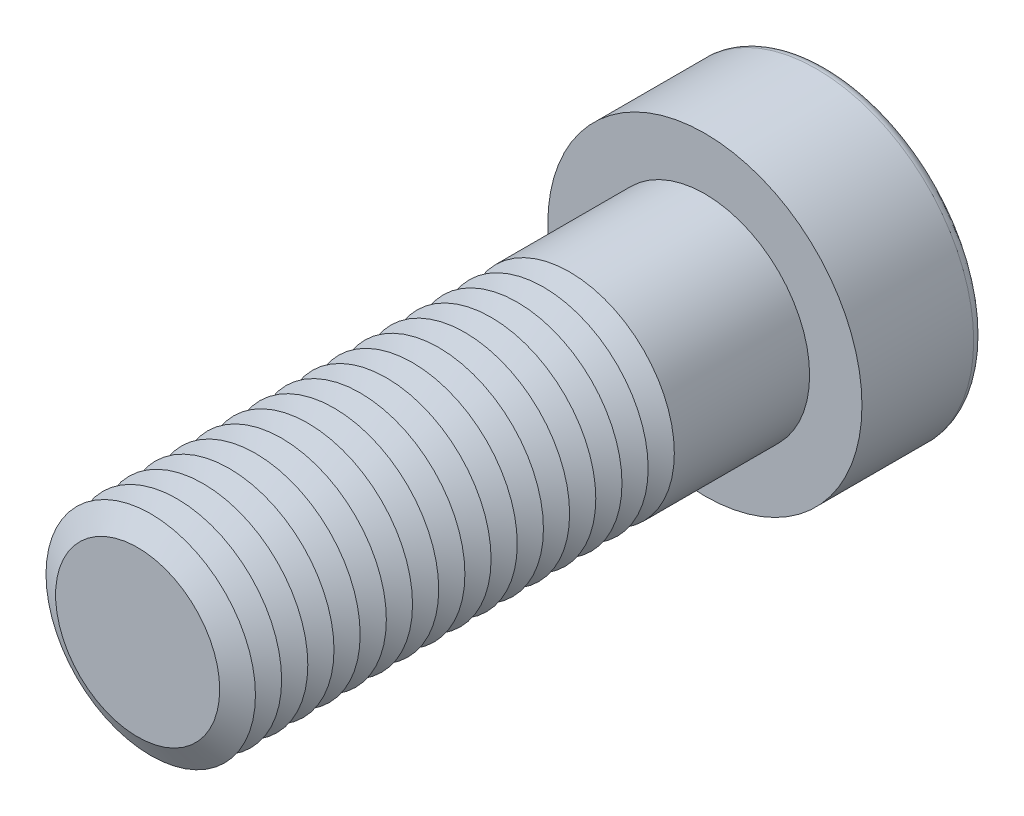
ISO-10303-21;
HEADER;
FILE_DESCRIPTION(('STEP AP214'),'2;1');
FILE_NAME('part.step','',(''),(''),'','','');
FILE_SCHEMA(('AUTOMOTIVE_DESIGN { 1 0 10303 214 1 1 1 1 }'));
ENDSEC;
DATA;
#1=APPLICATION_CONTEXT('core data for automotive mechanical design processes');
#2=APPLICATION_PROTOCOL_DEFINITION('international standard','automotive_design',2000,#1);
#3=PRODUCT_CONTEXT('',#1,'mechanical');
#4=PRODUCT('Part','Part','',(#3));
#5=PRODUCT_RELATED_PRODUCT_CATEGORY('part','',(#4));
#6=PRODUCT_DEFINITION_FORMATION('','',#4);
#7=PRODUCT_DEFINITION_CONTEXT('part definition',#1,'design');
#8=PRODUCT_DEFINITION('design','',#6,#7);
#9=PRODUCT_DEFINITION_SHAPE('','',#8);
#10=(LENGTH_UNIT() NAMED_UNIT(*) SI_UNIT(.MILLI.,.METRE.));
#11=(NAMED_UNIT(*) PLANE_ANGLE_UNIT() SI_UNIT($,.RADIAN.));
#12=(NAMED_UNIT(*) SI_UNIT($,.STERADIAN.) SOLID_ANGLE_UNIT());
#13=UNCERTAINTY_MEASURE_WITH_UNIT(LENGTH_MEASURE(1.E-05),#10,'distance_accuracy_value','');
#14=(GEOMETRIC_REPRESENTATION_CONTEXT(3) GLOBAL_UNCERTAINTY_ASSIGNED_CONTEXT((#13)) GLOBAL_UNIT_ASSIGNED_CONTEXT((#10,
#11,#12)) REPRESENTATION_CONTEXT('',''));
#15=CARTESIAN_POINT('',(0.,0.,0.));
#16=DIRECTION('',(0.,0.,1.));
#17=DIRECTION('',(1.,0.,0.));
#18=AXIS2_PLACEMENT_3D('',#15,#16,#17);
#19=CARTESIAN_POINT('',(0.,0.,54.5));
#20=DIRECTION('',(0.,0.,1.));
#21=DIRECTION('',(1.,0.,0.));
#22=AXIS2_PLACEMENT_3D('',#19,#20,#21);
#23=CONICAL_SURFACE('',#22,12.,1.0471975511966);
#24=CARTESIAN_POINT('',(0.,0.,53.));
#25=DIRECTION('',(0.,0.,1.));
#26=DIRECTION('',(1.,0.,0.));
#27=AXIS2_PLACEMENT_3D('',#24,#25,#26);
#28=CIRCLE('',#27,9.40192378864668);
#29=CARTESIAN_POINT('',(9.40192378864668,0.,53.));
#30=VERTEX_POINT('',#29);
#31=EDGE_CURVE('E313',#30,#30,#28,.T.);
#32=ORIENTED_EDGE('',*,*,#31,.T.);
#33=EDGE_LOOP('',(#32));
#34=FACE_BOUND('',#33,.T.);
#35=CARTESIAN_POINT('',(0.,0.,54.5));
#36=DIRECTION('',(0.,0.,1.));
#37=DIRECTION('',(1.,0.,0.));
#38=AXIS2_PLACEMENT_3D('',#35,#36,#37);
#39=CIRCLE('',#38,12.);
#40=CARTESIAN_POINT('',(12.,0.,54.5));
#41=VERTEX_POINT('',#40);
#42=EDGE_CURVE('E315',#41,#41,#39,.T.);
#43=ORIENTED_EDGE('',*,*,#42,.F.);
#44=EDGE_LOOP('',(#43));
#45=FACE_BOUND('',#44,.T.);
#46=ADVANCED_FACE('F39',(#34,#45),#23,.T.);
#47=CARTESIAN_POINT('',(0.,0.,53.));
#48=DIRECTION('',(0.,0.,-1.));
#49=DIRECTION('',(-1.,0.,0.));
#50=AXIS2_PLACEMENT_3D('',#47,#48,#49);
#51=CONICAL_SURFACE('',#50,9.40192378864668,1.0471975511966);
#52=CARTESIAN_POINT('',(0.,0.,51.5));
#53=DIRECTION('',(0.,0.,1.));
#54=DIRECTION('',(1.,0.,0.));
#55=AXIS2_PLACEMENT_3D('',#52,#53,#54);
#56=CIRCLE('',#55,12.);
#57=CARTESIAN_POINT('',(12.,0.,51.5));
#58=VERTEX_POINT('',#57);
#59=EDGE_CURVE('E323',#58,#58,#56,.T.);
#60=ORIENTED_EDGE('',*,*,#59,.T.);
#61=EDGE_LOOP('',(#60));
#62=FACE_BOUND('',#61,.T.);
#63=ORIENTED_EDGE('',*,*,#31,.F.);
#64=EDGE_LOOP('',(#63));
#65=FACE_BOUND('',#64,.T.);
#66=ADVANCED_FACE('F245',(#62,#65),#51,.T.);
#67=CARTESIAN_POINT('',(0.,0.,65.));
#68=DIRECTION('',(0.,0.,1.));
#69=DIRECTION('',(1.,0.,0.));
#70=AXIS2_PLACEMENT_3D('',#67,#68,#69);
#71=PLANE('',#70);
#72=CARTESIAN_POINT('',(0.,0.,65.));
#73=DIRECTION('',(0.,0.,1.));
#74=DIRECTION('',(1.,0.,0.));
#75=AXIS2_PLACEMENT_3D('',#72,#73,#74);
#76=CIRCLE('',#75,9.40192378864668);
#77=CARTESIAN_POINT('',(9.40192378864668,0.,65.));
#78=VERTEX_POINT('',#77);
#79=EDGE_CURVE('E174',#78,#78,#76,.T.);
#80=ORIENTED_EDGE('',*,*,#79,.T.);
#81=EDGE_LOOP('',(#80));
#82=FACE_BOUND('',#81,.T.);
#83=ADVANCED_FACE('F251',(#82),#71,.T.);
#84=CARTESIAN_POINT('',(0.,0.,65.));
#85=DIRECTION('',(0.,0.,-1.));
#86=DIRECTION('',(-1.,0.,0.));
#87=AXIS2_PLACEMENT_3D('',#84,#85,#86);
#88=CONICAL_SURFACE('',#87,9.40192378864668,1.0471975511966);
#89=CARTESIAN_POINT('',(0.,0.,63.5));
#90=DIRECTION('',(0.,0.,1.));
#91=DIRECTION('',(1.,0.,0.));
#92=AXIS2_PLACEMENT_3D('',#89,#90,#91);
#93=CIRCLE('',#92,12.);
#94=CARTESIAN_POINT('',(12.,0.,63.5));
#95=VERTEX_POINT('',#94);
#96=EDGE_CURVE('E291',#95,#95,#93,.T.);
#97=ORIENTED_EDGE('',*,*,#96,.T.);
#98=EDGE_LOOP('',(#97));
#99=FACE_BOUND('',#98,.T.);
#100=ORIENTED_EDGE('',*,*,#79,.F.);
#101=EDGE_LOOP('',(#100));
#102=FACE_BOUND('',#101,.T.);
#103=ADVANCED_FACE('F199',(#99,#102),#88,.T.);
#104=CARTESIAN_POINT('',(0.,0.,63.5));
#105=DIRECTION('',(0.,0.,1.));
#106=DIRECTION('',(1.,0.,0.));
#107=AXIS2_PLACEMENT_3D('',#104,#105,#106);
#108=CONICAL_SURFACE('',#107,12.,1.0471975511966);
#109=CARTESIAN_POINT('',(0.,0.,62.));
#110=DIRECTION('',(0.,0.,1.));
#111=DIRECTION('',(1.,0.,0.));
#112=AXIS2_PLACEMENT_3D('',#109,#110,#111);
#113=CIRCLE('',#112,9.40192378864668);
#114=CARTESIAN_POINT('',(9.40192378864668,0.,62.));
#115=VERTEX_POINT('',#114);
#116=EDGE_CURVE('E288',#115,#115,#113,.T.);
#117=ORIENTED_EDGE('',*,*,#116,.T.);
#118=EDGE_LOOP('',(#117));
#119=FACE_BOUND('',#118,.T.);
#120=ORIENTED_EDGE('',*,*,#96,.F.);
#121=EDGE_LOOP('',(#120));
#122=FACE_BOUND('',#121,.T.);
#123=ADVANCED_FACE('F277',(#119,#122),#108,.T.);
#124=CARTESIAN_POINT('',(0.,0.,62.));
#125=DIRECTION('',(0.,0.,-1.));
#126=DIRECTION('',(-1.,0.,0.));
#127=AXIS2_PLACEMENT_3D('',#124,#125,#126);
#128=CONICAL_SURFACE('',#127,9.40192378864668,1.0471975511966);
#129=CARTESIAN_POINT('',(0.,0.,60.5));
#130=DIRECTION('',(0.,0.,1.));
#131=DIRECTION('',(1.,0.,0.));
#132=AXIS2_PLACEMENT_3D('',#129,#130,#131);
#133=CIRCLE('',#132,12.);
#134=CARTESIAN_POINT('',(12.,0.,60.5));
#135=VERTEX_POINT('',#134);
#136=EDGE_CURVE('E299',#135,#135,#133,.T.);
#137=ORIENTED_EDGE('',*,*,#136,.T.);
#138=EDGE_LOOP('',(#137));
#139=FACE_BOUND('',#138,.T.);
#140=ORIENTED_EDGE('',*,*,#116,.F.);
#141=EDGE_LOOP('',(#140));
#142=FACE_BOUND('',#141,.T.);
#143=ADVANCED_FACE('F274',(#139,#142),#128,.T.);
#144=CARTESIAN_POINT('',(0.,0.,60.5));
#145=DIRECTION('',(0.,0.,1.));
#146=DIRECTION('',(1.,0.,0.));
#147=AXIS2_PLACEMENT_3D('',#144,#145,#146);
#148=CONICAL_SURFACE('',#147,12.,1.0471975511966);
#149=CARTESIAN_POINT('',(0.,0.,59.));
#150=DIRECTION('',(0.,0.,1.));
#151=DIRECTION('',(1.,0.,0.));
#152=AXIS2_PLACEMENT_3D('',#149,#150,#151);
#153=CIRCLE('',#152,9.40192378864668);
#154=CARTESIAN_POINT('',(9.40192378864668,0.,59.));
#155=VERTEX_POINT('',#154);
#156=EDGE_CURVE('E293',#155,#155,#153,.T.);
#157=ORIENTED_EDGE('',*,*,#156,.T.);
#158=EDGE_LOOP('',(#157));
#159=FACE_BOUND('',#158,.T.);
#160=ORIENTED_EDGE('',*,*,#136,.F.);
#161=EDGE_LOOP('',(#160));
#162=FACE_BOUND('',#161,.T.);
#163=ADVANCED_FACE('F270',(#159,#162),#148,.T.);
#164=CARTESIAN_POINT('',(0.,0.,59.));
#165=DIRECTION('',(0.,0.,-1.));
#166=DIRECTION('',(-1.,0.,0.));
#167=AXIS2_PLACEMENT_3D('',#164,#165,#166);
#168=CONICAL_SURFACE('',#167,9.40192378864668,1.0471975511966);
#169=CARTESIAN_POINT('',(0.,0.,57.5));
#170=DIRECTION('',(0.,0.,1.));
#171=DIRECTION('',(1.,0.,0.));
#172=AXIS2_PLACEMENT_3D('',#169,#170,#171);
#173=CIRCLE('',#172,12.);
#174=CARTESIAN_POINT('',(12.,0.,57.5));
#175=VERTEX_POINT('',#174);
#176=EDGE_CURVE('E309',#175,#175,#173,.T.);
#177=ORIENTED_EDGE('',*,*,#176,.T.);
#178=EDGE_LOOP('',(#177));
#179=FACE_BOUND('',#178,.T.);
#180=ORIENTED_EDGE('',*,*,#156,.F.);
#181=EDGE_LOOP('',(#180));
#182=FACE_BOUND('',#181,.T.);
#183=ADVANCED_FACE('F266',(#179,#182),#168,.T.);
#184=CARTESIAN_POINT('',(0.,0.,57.5));
#185=DIRECTION('',(0.,0.,1.));
#186=DIRECTION('',(1.,0.,0.));
#187=AXIS2_PLACEMENT_3D('',#184,#185,#186);
#188=CONICAL_SURFACE('',#187,12.,1.0471975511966);
#189=CARTESIAN_POINT('',(0.,0.,56.));
#190=DIRECTION('',(0.,0.,1.));
#191=DIRECTION('',(1.,0.,0.));
#192=AXIS2_PLACEMENT_3D('',#189,#190,#191);
#193=CIRCLE('',#192,9.40192378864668);
#194=CARTESIAN_POINT('',(9.40192378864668,0.,56.));
#195=VERTEX_POINT('',#194);
#196=EDGE_CURVE('E305',#195,#195,#193,.T.);
#197=ORIENTED_EDGE('',*,*,#196,.T.);
#198=EDGE_LOOP('',(#197));
#199=FACE_BOUND('',#198,.T.);
#200=ORIENTED_EDGE('',*,*,#176,.F.);
#201=EDGE_LOOP('',(#200));
#202=FACE_BOUND('',#201,.T.);
#203=ADVANCED_FACE('F262',(#199,#202),#188,.T.);
#204=CARTESIAN_POINT('',(0.,0.,56.));
#205=DIRECTION('',(0.,0.,-1.));
#206=DIRECTION('',(-1.,0.,0.));
#207=AXIS2_PLACEMENT_3D('',#204,#205,#206);
#208=CONICAL_SURFACE('',#207,9.40192378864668,1.0471975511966);
#209=ORIENTED_EDGE('',*,*,#42,.T.);
#210=EDGE_LOOP('',(#209));
#211=FACE_BOUND('',#210,.T.);
#212=ORIENTED_EDGE('',*,*,#196,.F.);
#213=EDGE_LOOP('',(#212));
#214=FACE_BOUND('',#213,.T.);
#215=ADVANCED_FACE('F258',(#211,#214),#208,.T.);
#216=CARTESIAN_POINT('',(0.,0.,51.5));
#217=DIRECTION('',(0.,0.,1.));
#218=DIRECTION('',(1.,0.,0.));
#219=AXIS2_PLACEMENT_3D('',#216,#217,#218);
#220=CONICAL_SURFACE('',#219,12.,1.0471975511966);
#221=CARTESIAN_POINT('',(0.,0.,50.));
#222=DIRECTION('',(0.,0.,1.));
#223=DIRECTION('',(1.,0.,0.));
#224=AXIS2_PLACEMENT_3D('',#221,#222,#223);
#225=CIRCLE('',#224,9.40192378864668);
#226=CARTESIAN_POINT('',(9.40192378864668,0.,50.));
#227=VERTEX_POINT('',#226);
#228=EDGE_CURVE('E319',#227,#227,#225,.T.);
#229=ORIENTED_EDGE('',*,*,#228,.T.);
#230=EDGE_LOOP('',(#229));
#231=FACE_BOUND('',#230,.T.);
#232=ORIENTED_EDGE('',*,*,#59,.F.);
#233=EDGE_LOOP('',(#232));
#234=FACE_BOUND('',#233,.T.);
#235=ADVANCED_FACE('F261',(#231,#234),#220,.T.);
#236=CARTESIAN_POINT('',(0.,0.,50.));
#237=DIRECTION('',(0.,0.,-1.));
#238=DIRECTION('',(-1.,0.,0.));
#239=AXIS2_PLACEMENT_3D('',#236,#237,#238);
#240=CONICAL_SURFACE('',#239,9.40192378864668,1.0471975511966);
#241=CARTESIAN_POINT('',(0.,0.,48.5));
#242=DIRECTION('',(0.,0.,1.));
#243=DIRECTION('',(1.,0.,0.));
#244=AXIS2_PLACEMENT_3D('',#241,#242,#243);
#245=CIRCLE('',#244,12.);
#246=CARTESIAN_POINT('',(12.,0.,48.5));
#247=VERTEX_POINT('',#246);
#248=EDGE_CURVE('E331',#247,#247,#245,.T.);
#249=ORIENTED_EDGE('',*,*,#248,.T.);
#250=EDGE_LOOP('',(#249));
#251=FACE_BOUND('',#250,.T.);
#252=ORIENTED_EDGE('',*,*,#228,.F.);
#253=EDGE_LOOP('',(#252));
#254=FACE_BOUND('',#253,.T.);
#255=ADVANCED_FACE('F512',(#251,#254),#240,.T.);
#256=CARTESIAN_POINT('',(0.,0.,48.5));
#257=DIRECTION('',(0.,0.,1.));
#258=DIRECTION('',(1.,0.,0.));
#259=AXIS2_PLACEMENT_3D('',#256,#257,#258);
#260=CONICAL_SURFACE('',#259,12.,1.0471975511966);
#261=CARTESIAN_POINT('',(0.,0.,47.));
#262=DIRECTION('',(0.,0.,1.));
#263=DIRECTION('',(1.,0.,0.));
#264=AXIS2_PLACEMENT_3D('',#261,#262,#263);
#265=CIRCLE('',#264,9.40192378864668);
#266=CARTESIAN_POINT('',(9.40192378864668,0.,47.));
#267=VERTEX_POINT('',#266);
#268=EDGE_CURVE('E327',#267,#267,#265,.T.);
#269=ORIENTED_EDGE('',*,*,#268,.T.);
#270=EDGE_LOOP('',(#269));
#271=FACE_BOUND('',#270,.T.);
#272=ORIENTED_EDGE('',*,*,#248,.F.);
#273=EDGE_LOOP('',(#272));
#274=FACE_BOUND('',#273,.T.);
#275=ADVANCED_FACE('F508',(#271,#274),#260,.T.);
#276=CARTESIAN_POINT('',(0.,0.,47.));
#277=DIRECTION('',(0.,0.,-1.));
#278=DIRECTION('',(-1.,0.,0.));
#279=AXIS2_PLACEMENT_3D('',#276,#277,#278);
#280=CONICAL_SURFACE('',#279,9.40192378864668,1.0471975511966);
#281=CARTESIAN_POINT('',(0.,0.,45.5));
#282=DIRECTION('',(0.,0.,1.));
#283=DIRECTION('',(1.,0.,0.));
#284=AXIS2_PLACEMENT_3D('',#281,#282,#283);
#285=CIRCLE('',#284,12.);
#286=CARTESIAN_POINT('',(12.,0.,45.5));
#287=VERTEX_POINT('',#286);
#288=EDGE_CURVE('E339',#287,#287,#285,.T.);
#289=ORIENTED_EDGE('',*,*,#288,.T.);
#290=EDGE_LOOP('',(#289));
#291=FACE_BOUND('',#290,.T.);
#292=ORIENTED_EDGE('',*,*,#268,.F.);
#293=EDGE_LOOP('',(#292));
#294=FACE_BOUND('',#293,.T.);
#295=ADVANCED_FACE('F504',(#291,#294),#280,.T.);
#296=CARTESIAN_POINT('',(0.,0.,45.5));
#297=DIRECTION('',(0.,0.,1.));
#298=DIRECTION('',(1.,0.,0.));
#299=AXIS2_PLACEMENT_3D('',#296,#297,#298);
#300=CONICAL_SURFACE('',#299,12.,1.0471975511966);
#301=CARTESIAN_POINT('',(0.,0.,44.));
#302=DIRECTION('',(0.,0.,1.));
#303=DIRECTION('',(1.,0.,0.));
#304=AXIS2_PLACEMENT_3D('',#301,#302,#303);
#305=CIRCLE('',#304,9.40192378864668);
#306=CARTESIAN_POINT('',(9.40192378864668,0.,44.));
#307=VERTEX_POINT('',#306);
#308=EDGE_CURVE('E335',#307,#307,#305,.T.);
#309=ORIENTED_EDGE('',*,*,#308,.T.);
#310=EDGE_LOOP('',(#309));
#311=FACE_BOUND('',#310,.T.);
#312=ORIENTED_EDGE('',*,*,#288,.F.);
#313=EDGE_LOOP('',(#312));
#314=FACE_BOUND('',#313,.T.);
#315=ADVANCED_FACE('F500',(#311,#314),#300,.T.);
#316=CARTESIAN_POINT('',(0.,0.,44.));
#317=DIRECTION('',(0.,0.,-1.));
#318=DIRECTION('',(-1.,0.,0.));
#319=AXIS2_PLACEMENT_3D('',#316,#317,#318);
#320=CONICAL_SURFACE('',#319,9.40192378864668,1.0471975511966);
#321=CARTESIAN_POINT('',(0.,0.,42.5));
#322=DIRECTION('',(0.,0.,1.));
#323=DIRECTION('',(1.,0.,0.));
#324=AXIS2_PLACEMENT_3D('',#321,#322,#323);
#325=CIRCLE('',#324,12.);
#326=CARTESIAN_POINT('',(12.,0.,42.5));
#327=VERTEX_POINT('',#326);
#328=EDGE_CURVE('E347',#327,#327,#325,.T.);
#329=ORIENTED_EDGE('',*,*,#328,.T.);
#330=EDGE_LOOP('',(#329));
#331=FACE_BOUND('',#330,.T.);
#332=ORIENTED_EDGE('',*,*,#308,.F.);
#333=EDGE_LOOP('',(#332));
#334=FACE_BOUND('',#333,.T.);
#335=ADVANCED_FACE('F496',(#331,#334),#320,.T.);
#336=CARTESIAN_POINT('',(0.,0.,42.5));
#337=DIRECTION('',(0.,0.,1.));
#338=DIRECTION('',(1.,0.,0.));
#339=AXIS2_PLACEMENT_3D('',#336,#337,#338);
#340=CONICAL_SURFACE('',#339,12.,1.0471975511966);
#341=CARTESIAN_POINT('',(0.,0.,41.));
#342=DIRECTION('',(0.,0.,1.));
#343=DIRECTION('',(1.,0.,0.));
#344=AXIS2_PLACEMENT_3D('',#341,#342,#343);
#345=CIRCLE('',#344,9.40192378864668);
#346=CARTESIAN_POINT('',(9.40192378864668,0.,41.));
#347=VERTEX_POINT('',#346);
#348=EDGE_CURVE('E343',#347,#347,#345,.T.);
#349=ORIENTED_EDGE('',*,*,#348,.T.);
#350=EDGE_LOOP('',(#349));
#351=FACE_BOUND('',#350,.T.);
#352=ORIENTED_EDGE('',*,*,#328,.F.);
#353=EDGE_LOOP('',(#352));
#354=FACE_BOUND('',#353,.T.);
#355=ADVANCED_FACE('F492',(#351,#354),#340,.T.);
#356=CARTESIAN_POINT('',(0.,0.,41.));
#357=DIRECTION('',(0.,0.,-1.));
#358=DIRECTION('',(-1.,0.,0.));
#359=AXIS2_PLACEMENT_3D('',#356,#357,#358);
#360=CONICAL_SURFACE('',#359,9.40192378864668,1.0471975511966);
#361=CARTESIAN_POINT('',(0.,0.,39.5));
#362=DIRECTION('',(0.,0.,1.));
#363=DIRECTION('',(1.,0.,0.));
#364=AXIS2_PLACEMENT_3D('',#361,#362,#363);
#365=CIRCLE('',#364,12.);
#366=CARTESIAN_POINT('',(12.,0.,39.5));
#367=VERTEX_POINT('',#366);
#368=EDGE_CURVE('E355',#367,#367,#365,.T.);
#369=ORIENTED_EDGE('',*,*,#368,.T.);
#370=EDGE_LOOP('',(#369));
#371=FACE_BOUND('',#370,.T.);
#372=ORIENTED_EDGE('',*,*,#348,.F.);
#373=EDGE_LOOP('',(#372));
#374=FACE_BOUND('',#373,.T.);
#375=ADVANCED_FACE('F488',(#371,#374),#360,.T.);
#376=CARTESIAN_POINT('',(0.,0.,39.5));
#377=DIRECTION('',(0.,0.,1.));
#378=DIRECTION('',(1.,0.,0.));
#379=AXIS2_PLACEMENT_3D('',#376,#377,#378);
#380=CONICAL_SURFACE('',#379,12.,1.0471975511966);
#381=CARTESIAN_POINT('',(0.,0.,38.));
#382=DIRECTION('',(0.,0.,1.));
#383=DIRECTION('',(1.,0.,0.));
#384=AXIS2_PLACEMENT_3D('',#381,#382,#383);
#385=CIRCLE('',#384,9.40192378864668);
#386=CARTESIAN_POINT('',(9.40192378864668,0.,38.));
#387=VERTEX_POINT('',#386);
#388=EDGE_CURVE('E351',#387,#387,#385,.T.);
#389=ORIENTED_EDGE('',*,*,#388,.T.);
#390=EDGE_LOOP('',(#389));
#391=FACE_BOUND('',#390,.T.);
#392=ORIENTED_EDGE('',*,*,#368,.F.);
#393=EDGE_LOOP('',(#392));
#394=FACE_BOUND('',#393,.T.);
#395=ADVANCED_FACE('F484',(#391,#394),#380,.T.);
#396=CARTESIAN_POINT('',(0.,0.,38.));
#397=DIRECTION('',(0.,0.,-1.));
#398=DIRECTION('',(-1.,0.,0.));
#399=AXIS2_PLACEMENT_3D('',#396,#397,#398);
#400=CONICAL_SURFACE('',#399,9.40192378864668,1.0471975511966);
#401=CARTESIAN_POINT('',(0.,0.,36.5));
#402=DIRECTION('',(0.,0.,1.));
#403=DIRECTION('',(1.,0.,0.));
#404=AXIS2_PLACEMENT_3D('',#401,#402,#403);
#405=CIRCLE('',#404,12.);
#406=CARTESIAN_POINT('',(12.,0.,36.5));
#407=VERTEX_POINT('',#406);
#408=EDGE_CURVE('E363',#407,#407,#405,.T.);
#409=ORIENTED_EDGE('',*,*,#408,.T.);
#410=EDGE_LOOP('',(#409));
#411=FACE_BOUND('',#410,.T.);
#412=ORIENTED_EDGE('',*,*,#388,.F.);
#413=EDGE_LOOP('',(#412));
#414=FACE_BOUND('',#413,.T.);
#415=ADVANCED_FACE('F480',(#411,#414),#400,.T.);
#416=CARTESIAN_POINT('',(0.,0.,36.5));
#417=DIRECTION('',(0.,0.,1.));
#418=DIRECTION('',(1.,0.,0.));
#419=AXIS2_PLACEMENT_3D('',#416,#417,#418);
#420=CONICAL_SURFACE('',#419,12.,1.0471975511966);
#421=CARTESIAN_POINT('',(0.,0.,35.));
#422=DIRECTION('',(0.,0.,1.));
#423=DIRECTION('',(1.,0.,0.));
#424=AXIS2_PLACEMENT_3D('',#421,#422,#423);
#425=CIRCLE('',#424,9.40192378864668);
#426=CARTESIAN_POINT('',(9.40192378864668,0.,35.));
#427=VERTEX_POINT('',#426);
#428=EDGE_CURVE('E359',#427,#427,#425,.T.);
#429=ORIENTED_EDGE('',*,*,#428,.T.);
#430=EDGE_LOOP('',(#429));
#431=FACE_BOUND('',#430,.T.);
#432=ORIENTED_EDGE('',*,*,#408,.F.);
#433=EDGE_LOOP('',(#432));
#434=FACE_BOUND('',#433,.T.);
#435=ADVANCED_FACE('F476',(#431,#434),#420,.T.);
#436=CARTESIAN_POINT('',(0.,0.,35.));
#437=DIRECTION('',(0.,0.,-1.));
#438=DIRECTION('',(-1.,0.,0.));
#439=AXIS2_PLACEMENT_3D('',#436,#437,#438);
#440=CONICAL_SURFACE('',#439,9.40192378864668,1.0471975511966);
#441=CARTESIAN_POINT('',(0.,0.,33.5));
#442=DIRECTION('',(0.,0.,1.));
#443=DIRECTION('',(1.,0.,0.));
#444=AXIS2_PLACEMENT_3D('',#441,#442,#443);
#445=CIRCLE('',#444,12.);
#446=CARTESIAN_POINT('',(12.,0.,33.5));
#447=VERTEX_POINT('',#446);
#448=EDGE_CURVE('E371',#447,#447,#445,.T.);
#449=ORIENTED_EDGE('',*,*,#448,.T.);
#450=EDGE_LOOP('',(#449));
#451=FACE_BOUND('',#450,.T.);
#452=ORIENTED_EDGE('',*,*,#428,.F.);
#453=EDGE_LOOP('',(#452));
#454=FACE_BOUND('',#453,.T.);
#455=ADVANCED_FACE('F472',(#451,#454),#440,.T.);
#456=CARTESIAN_POINT('',(0.,0.,33.5));
#457=DIRECTION('',(0.,0.,1.));
#458=DIRECTION('',(1.,0.,0.));
#459=AXIS2_PLACEMENT_3D('',#456,#457,#458);
#460=CONICAL_SURFACE('',#459,12.,1.0471975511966);
#461=CARTESIAN_POINT('',(0.,0.,32.));
#462=DIRECTION('',(0.,0.,1.));
#463=DIRECTION('',(1.,0.,0.));
#464=AXIS2_PLACEMENT_3D('',#461,#462,#463);
#465=CIRCLE('',#464,9.40192378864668);
#466=CARTESIAN_POINT('',(9.40192378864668,0.,32.));
#467=VERTEX_POINT('',#466);
#468=EDGE_CURVE('E367',#467,#467,#465,.T.);
#469=ORIENTED_EDGE('',*,*,#468,.T.);
#470=EDGE_LOOP('',(#469));
#471=FACE_BOUND('',#470,.T.);
#472=ORIENTED_EDGE('',*,*,#448,.F.);
#473=EDGE_LOOP('',(#472));
#474=FACE_BOUND('',#473,.T.);
#475=ADVANCED_FACE('F468',(#471,#474),#460,.T.);
#476=CARTESIAN_POINT('',(0.,0.,32.));
#477=DIRECTION('',(0.,0.,-1.));
#478=DIRECTION('',(-1.,0.,0.));
#479=AXIS2_PLACEMENT_3D('',#476,#477,#478);
#480=CONICAL_SURFACE('',#479,9.40192378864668,1.0471975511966);
#481=CARTESIAN_POINT('',(0.,0.,30.5));
#482=DIRECTION('',(0.,0.,1.));
#483=DIRECTION('',(1.,0.,0.));
#484=AXIS2_PLACEMENT_3D('',#481,#482,#483);
#485=CIRCLE('',#484,12.);
#486=CARTESIAN_POINT('',(12.,0.,30.5));
#487=VERTEX_POINT('',#486);
#488=EDGE_CURVE('E379',#487,#487,#485,.T.);
#489=ORIENTED_EDGE('',*,*,#488,.T.);
#490=EDGE_LOOP('',(#489));
#491=FACE_BOUND('',#490,.T.);
#492=ORIENTED_EDGE('',*,*,#468,.F.);
#493=EDGE_LOOP('',(#492));
#494=FACE_BOUND('',#493,.T.);
#495=ADVANCED_FACE('F464',(#491,#494),#480,.T.);
#496=CARTESIAN_POINT('',(0.,0.,30.5));
#497=DIRECTION('',(0.,0.,1.));
#498=DIRECTION('',(1.,0.,0.));
#499=AXIS2_PLACEMENT_3D('',#496,#497,#498);
#500=CONICAL_SURFACE('',#499,12.,1.0471975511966);
#501=CARTESIAN_POINT('',(0.,0.,29.));
#502=DIRECTION('',(0.,0.,1.));
#503=DIRECTION('',(1.,0.,0.));
#504=AXIS2_PLACEMENT_3D('',#501,#502,#503);
#505=CIRCLE('',#504,9.40192378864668);
#506=CARTESIAN_POINT('',(9.40192378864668,0.,29.));
#507=VERTEX_POINT('',#506);
#508=EDGE_CURVE('E375',#507,#507,#505,.T.);
#509=ORIENTED_EDGE('',*,*,#508,.T.);
#510=EDGE_LOOP('',(#509));
#511=FACE_BOUND('',#510,.T.);
#512=ORIENTED_EDGE('',*,*,#488,.F.);
#513=EDGE_LOOP('',(#512));
#514=FACE_BOUND('',#513,.T.);
#515=ADVANCED_FACE('F460',(#511,#514),#500,.T.);
#516=CARTESIAN_POINT('',(0.,0.,29.));
#517=DIRECTION('',(0.,0.,-1.));
#518=DIRECTION('',(-1.,0.,0.));
#519=AXIS2_PLACEMENT_3D('',#516,#517,#518);
#520=CONICAL_SURFACE('',#519,9.40192378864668,1.0471975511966);
#521=CARTESIAN_POINT('',(0.,0.,27.5));
#522=DIRECTION('',(0.,0.,1.));
#523=DIRECTION('',(1.,0.,0.));
#524=AXIS2_PLACEMENT_3D('',#521,#522,#523);
#525=CIRCLE('',#524,12.);
#526=CARTESIAN_POINT('',(12.,0.,27.5));
#527=VERTEX_POINT('',#526);
#528=EDGE_CURVE('E387',#527,#527,#525,.T.);
#529=ORIENTED_EDGE('',*,*,#528,.T.);
#530=EDGE_LOOP('',(#529));
#531=FACE_BOUND('',#530,.T.);
#532=ORIENTED_EDGE('',*,*,#508,.F.);
#533=EDGE_LOOP('',(#532));
#534=FACE_BOUND('',#533,.T.);
#535=ADVANCED_FACE('F456',(#531,#534),#520,.T.);
#536=CARTESIAN_POINT('',(0.,0.,27.5));
#537=DIRECTION('',(0.,0.,1.));
#538=DIRECTION('',(1.,0.,0.));
#539=AXIS2_PLACEMENT_3D('',#536,#537,#538);
#540=CONICAL_SURFACE('',#539,12.,1.0471975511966);
#541=CARTESIAN_POINT('',(0.,0.,26.));
#542=DIRECTION('',(0.,0.,1.));
#543=DIRECTION('',(1.,0.,0.));
#544=AXIS2_PLACEMENT_3D('',#541,#542,#543);
#545=CIRCLE('',#544,9.40192378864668);
#546=CARTESIAN_POINT('',(9.40192378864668,0.,26.));
#547=VERTEX_POINT('',#546);
#548=EDGE_CURVE('E383',#547,#547,#545,.T.);
#549=ORIENTED_EDGE('',*,*,#548,.T.);
#550=EDGE_LOOP('',(#549));
#551=FACE_BOUND('',#550,.T.);
#552=ORIENTED_EDGE('',*,*,#528,.F.);
#553=EDGE_LOOP('',(#552));
#554=FACE_BOUND('',#553,.T.);
#555=ADVANCED_FACE('F452',(#551,#554),#540,.T.);
#556=CARTESIAN_POINT('',(0.,0.,26.));
#557=DIRECTION('',(0.,0.,-1.));
#558=DIRECTION('',(-1.,0.,0.));
#559=AXIS2_PLACEMENT_3D('',#556,#557,#558);
#560=CONICAL_SURFACE('',#559,9.40192378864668,1.0471975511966);
#561=CARTESIAN_POINT('',(0.,0.,24.5));
#562=DIRECTION('',(0.,0.,1.));
#563=DIRECTION('',(1.,0.,0.));
#564=AXIS2_PLACEMENT_3D('',#561,#562,#563);
#565=CIRCLE('',#564,12.);
#566=CARTESIAN_POINT('',(12.,0.,24.5));
#567=VERTEX_POINT('',#566);
#568=EDGE_CURVE('E395',#567,#567,#565,.T.);
#569=ORIENTED_EDGE('',*,*,#568,.T.);
#570=EDGE_LOOP('',(#569));
#571=FACE_BOUND('',#570,.T.);
#572=ORIENTED_EDGE('',*,*,#548,.F.);
#573=EDGE_LOOP('',(#572));
#574=FACE_BOUND('',#573,.T.);
#575=ADVANCED_FACE('F448',(#571,#574),#560,.T.);
#576=CARTESIAN_POINT('',(0.,0.,24.5));
#577=DIRECTION('',(0.,0.,1.));
#578=DIRECTION('',(1.,0.,0.));
#579=AXIS2_PLACEMENT_3D('',#576,#577,#578);
#580=CONICAL_SURFACE('',#579,12.,1.0471975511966);
#581=CARTESIAN_POINT('',(0.,0.,23.));
#582=DIRECTION('',(0.,0.,1.));
#583=DIRECTION('',(1.,0.,0.));
#584=AXIS2_PLACEMENT_3D('',#581,#582,#583);
#585=CIRCLE('',#584,9.40192378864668);
#586=CARTESIAN_POINT('',(9.40192378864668,0.,23.));
#587=VERTEX_POINT('',#586);
#588=EDGE_CURVE('E391',#587,#587,#585,.T.);
#589=ORIENTED_EDGE('',*,*,#588,.T.);
#590=EDGE_LOOP('',(#589));
#591=FACE_BOUND('',#590,.T.);
#592=ORIENTED_EDGE('',*,*,#568,.F.);
#593=EDGE_LOOP('',(#592));
#594=FACE_BOUND('',#593,.T.);
#595=ADVANCED_FACE('F444',(#591,#594),#580,.T.);
#596=CARTESIAN_POINT('',(0.,0.,23.));
#597=DIRECTION('',(0.,0.,-1.));
#598=DIRECTION('',(-1.,0.,0.));
#599=AXIS2_PLACEMENT_3D('',#596,#597,#598);
#600=CONICAL_SURFACE('',#599,9.40192378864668,1.0471975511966);
#601=CARTESIAN_POINT('',(0.,0.,21.5));
#602=DIRECTION('',(0.,0.,1.));
#603=DIRECTION('',(1.,0.,0.));
#604=AXIS2_PLACEMENT_3D('',#601,#602,#603);
#605=CIRCLE('',#604,12.);
#606=CARTESIAN_POINT('',(12.,0.,21.5));
#607=VERTEX_POINT('',#606);
#608=EDGE_CURVE('E403',#607,#607,#605,.T.);
#609=ORIENTED_EDGE('',*,*,#608,.T.);
#610=EDGE_LOOP('',(#609));
#611=FACE_BOUND('',#610,.T.);
#612=ORIENTED_EDGE('',*,*,#588,.F.);
#613=EDGE_LOOP('',(#612));
#614=FACE_BOUND('',#613,.T.);
#615=ADVANCED_FACE('F440',(#611,#614),#600,.T.);
#616=CARTESIAN_POINT('',(0.,0.,21.5));
#617=DIRECTION('',(0.,0.,1.));
#618=DIRECTION('',(1.,0.,0.));
#619=AXIS2_PLACEMENT_3D('',#616,#617,#618);
#620=CONICAL_SURFACE('',#619,12.,1.0471975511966);
#621=CARTESIAN_POINT('',(0.,0.,20.));
#622=DIRECTION('',(0.,0.,1.));
#623=DIRECTION('',(1.,0.,0.));
#624=AXIS2_PLACEMENT_3D('',#621,#622,#623);
#625=CIRCLE('',#624,9.40192378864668);
#626=CARTESIAN_POINT('',(9.40192378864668,0.,20.));
#627=VERTEX_POINT('',#626);
#628=EDGE_CURVE('E399',#627,#627,#625,.T.);
#629=ORIENTED_EDGE('',*,*,#628,.T.);
#630=EDGE_LOOP('',(#629));
#631=FACE_BOUND('',#630,.T.);
#632=ORIENTED_EDGE('',*,*,#608,.F.);
#633=EDGE_LOOP('',(#632));
#634=FACE_BOUND('',#633,.T.);
#635=ADVANCED_FACE('F435',(#631,#634),#620,.T.);
#636=CARTESIAN_POINT('',(0.,0.,20.));
#637=DIRECTION('',(0.,0.,-1.));
#638=DIRECTION('',(-1.,0.,0.));
#639=AXIS2_PLACEMENT_3D('',#636,#637,#638);
#640=CONICAL_SURFACE('',#639,9.40192378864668,1.0471975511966);
#641=CARTESIAN_POINT('',(0.,0.,18.5));
#642=DIRECTION('',(0.,0.,1.));
#643=DIRECTION('',(1.,0.,0.));
#644=AXIS2_PLACEMENT_3D('',#641,#642,#643);
#645=CIRCLE('',#644,12.);
#646=CARTESIAN_POINT('',(12.,0.,18.5));
#647=VERTEX_POINT('',#646);
#648=EDGE_CURVE('E415',#647,#647,#645,.T.);
#649=ORIENTED_EDGE('',*,*,#648,.T.);
#650=EDGE_LOOP('',(#649));
#651=FACE_BOUND('',#650,.T.);
#652=ORIENTED_EDGE('',*,*,#628,.F.);
#653=EDGE_LOOP('',(#652));
#654=FACE_BOUND('',#653,.T.);
#655=ADVANCED_FACE('F421',(#651,#654),#640,.T.);
#656=CARTESIAN_POINT('',(0.,0.,18.5));
#657=DIRECTION('',(0.,0.,1.));
#658=DIRECTION('',(1.,0.,0.));
#659=AXIS2_PLACEMENT_3D('',#656,#657,#658);
#660=CONICAL_SURFACE('',#659,12.,1.0471975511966);
#661=CARTESIAN_POINT('',(0.,0.,17.));
#662=DIRECTION('',(0.,0.,1.));
#663=DIRECTION('',(1.,0.,0.));
#664=AXIS2_PLACEMENT_3D('',#661,#662,#663);
#665=CIRCLE('',#664,9.40192378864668);
#666=CARTESIAN_POINT('',(9.40192378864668,0.,17.));
#667=VERTEX_POINT('',#666);
#668=EDGE_CURVE('E407',#667,#667,#665,.T.);
#669=ORIENTED_EDGE('',*,*,#668,.T.);
#670=EDGE_LOOP('',(#669));
#671=FACE_BOUND('',#670,.T.);
#672=ORIENTED_EDGE('',*,*,#648,.F.);
#673=EDGE_LOOP('',(#672));
#674=FACE_BOUND('',#673,.T.);
#675=ADVANCED_FACE('F424',(#671,#674),#660,.T.);
#676=CARTESIAN_POINT('',(0.,0.,17.));
#677=DIRECTION('',(0.,0.,-1.));
#678=DIRECTION('',(-1.,0.,0.));
#679=AXIS2_PLACEMENT_3D('',#676,#677,#678);
#680=CONICAL_SURFACE('',#679,9.40192378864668,1.0471975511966);
#681=CARTESIAN_POINT('',(0.,0.,15.5));
#682=DIRECTION('',(0.,0.,1.));
#683=DIRECTION('',(1.,0.,0.));
#684=AXIS2_PLACEMENT_3D('',#681,#682,#683);
#685=CIRCLE('',#684,12.);
#686=CARTESIAN_POINT('',(12.,0.,15.5));
#687=VERTEX_POINT('',#686);
#688=EDGE_CURVE('E411',#687,#687,#685,.T.);
#689=ORIENTED_EDGE('',*,*,#688,.T.);
#690=EDGE_LOOP('',(#689));
#691=FACE_BOUND('',#690,.T.);
#692=ORIENTED_EDGE('',*,*,#668,.F.);
#693=EDGE_LOOP('',(#692));
#694=FACE_BOUND('',#693,.T.);
#695=ADVANCED_FACE('F426',(#691,#694),#680,.T.);
#696=CARTESIAN_POINT('',(0.,0.,0.25));
#697=DIRECTION('',(0.,0.,-1.));
#698=DIRECTION('',(-1.,0.,0.));
#699=AXIS2_PLACEMENT_3D('',#696,#697,#698);
#700=CONICAL_SURFACE('',#699,9.5,1.0471975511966);
#701=CARTESIAN_POINT('',(0.,0.,5.73482755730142));
#702=VERTEX_POINT('',#701);
#703=VERTEX_LOOP('',#702);
#704=FACE_BOUND('',#703,.T.);
#705=CARTESIAN_POINT('',(0.,0.,0.25));
#706=DIRECTION('',(0.,0.,-1.));
#707=DIRECTION('',(-1.,0.,0.));
#708=AXIS2_PLACEMENT_3D('',#705,#706,#707);
#709=CIRCLE('',#708,9.5);
#710=CARTESIAN_POINT('',(-8.22724133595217,4.75,0.25));
#711=VERTEX_POINT('',#710);
#712=CARTESIAN_POINT('',(0.,9.5,0.25));
#713=VERTEX_POINT('',#712);
#714=EDGE_CURVE('E149',#711,#713,#709,.T.);
#715=ORIENTED_EDGE('',*,*,#714,.T.);
#716=CARTESIAN_POINT('',(0.,0.,0.25));
#717=DIRECTION('',(0.,0.,-1.));
#718=DIRECTION('',(-1.,0.,0.));
#719=AXIS2_PLACEMENT_3D('',#716,#717,#718);
#720=CIRCLE('',#719,9.5);
#721=CARTESIAN_POINT('',(8.22724133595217,4.75,0.25));
#722=VERTEX_POINT('',#721);
#723=EDGE_CURVE('E54',#713,#722,#720,.T.);
#724=ORIENTED_EDGE('',*,*,#723,.T.);
#725=CARTESIAN_POINT('',(8.22724133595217,-4.75,0.25));
#726=VERTEX_POINT('',#725);
#727=EDGE_CURVE('E1027',#722,#726,#720,.T.);
#728=ORIENTED_EDGE('',*,*,#727,.T.);
#729=CARTESIAN_POINT('',(0.,-9.5,0.25));
#730=VERTEX_POINT('',#729);
#731=EDGE_CURVE('E1025',#726,#730,#720,.T.);
#732=ORIENTED_EDGE('',*,*,#731,.T.);
#733=CARTESIAN_POINT('',(-8.22724133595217,-4.75,0.25));
#734=VERTEX_POINT('',#733);
#735=EDGE_CURVE('E1019',#730,#734,#720,.T.);
#736=ORIENTED_EDGE('',*,*,#735,.T.);
#737=EDGE_CURVE('E1017',#734,#711,#720,.T.);
#738=ORIENTED_EDGE('',*,*,#737,.T.);
#739=EDGE_LOOP('',(#715,#724,#728,#732,#736,#738));
#740=FACE_BOUND('',#739,.T.);
#741=ADVANCED_FACE('F201',(#704,#740),#700,.F.);
#742=CARTESIAN_POINT('',(0.,0.,0.25));
#743=DIRECTION('',(0.,0.,-1.));
#744=DIRECTION('',(-1.,0.,0.));
#745=AXIS2_PLACEMENT_3D('',#742,#743,#744);
#746=PLANE('',#745);
#747=ORIENTED_EDGE('',*,*,#723,.F.);
#748=DIRECTION('',(1.,0.,0.));
#749=VECTOR('',#748,1.);
#750=CARTESIAN_POINT('',(-5.48482755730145,9.5,0.25));
#751=LINE('',#750,#749);
#752=CARTESIAN_POINT('',(5.48482755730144,9.5,0.25));
#753=VERTEX_POINT('',#752);
#754=EDGE_CURVE('E1068',#713,#753,#751,.T.);
#755=ORIENTED_EDGE('',*,*,#754,.T.);
#756=DIRECTION('',(0.5,-0.866025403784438,0.));
#757=VECTOR('',#756,1.);
#758=CARTESIAN_POINT('',(5.48482755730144,9.5,0.25));
#759=LINE('',#758,#757);
#760=EDGE_CURVE('E155',#753,#722,#759,.T.);
#761=ORIENTED_EDGE('',*,*,#760,.T.);
#762=EDGE_LOOP('',(#747,#755,#761));
#763=FACE_BOUND('',#762,.T.);
#764=ADVANCED_FACE('F607',(#763),#746,.T.);
#765=ORIENTED_EDGE('',*,*,#727,.F.);
#766=CARTESIAN_POINT('',(10.9696551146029,0.,0.25));
#767=VERTEX_POINT('',#766);
#768=EDGE_CURVE('E1067',#722,#767,#759,.T.);
#769=ORIENTED_EDGE('',*,*,#768,.T.);
#770=DIRECTION('',(-0.5,-0.866025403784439,0.));
#771=VECTOR('',#770,1.);
#772=CARTESIAN_POINT('',(10.9696551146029,0.,0.25));
#773=LINE('',#772,#771);
#774=EDGE_CURVE('E1040',#767,#726,#773,.T.);
#775=ORIENTED_EDGE('',*,*,#774,.T.);
#776=EDGE_LOOP('',(#765,#769,#775));
#777=FACE_BOUND('',#776,.T.);
#778=ADVANCED_FACE('F617',(#777),#746,.T.);
#779=ORIENTED_EDGE('',*,*,#731,.F.);
#780=CARTESIAN_POINT('',(5.48482755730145,-9.5,0.25));
#781=VERTEX_POINT('',#780);
#782=EDGE_CURVE('E1042',#726,#781,#773,.T.);
#783=ORIENTED_EDGE('',*,*,#782,.T.);
#784=DIRECTION('',(-1.,0.,0.));
#785=VECTOR('',#784,1.);
#786=CARTESIAN_POINT('',(5.48482755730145,-9.5,0.25));
#787=LINE('',#786,#785);
#788=EDGE_CURVE('E994',#781,#730,#787,.T.);
#789=ORIENTED_EDGE('',*,*,#788,.T.);
#790=EDGE_LOOP('',(#779,#783,#789));
#791=FACE_BOUND('',#790,.T.);
#792=ADVANCED_FACE('F627',(#791),#746,.T.);
#793=ORIENTED_EDGE('',*,*,#735,.F.);
#794=CARTESIAN_POINT('',(-5.48482755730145,-9.5,0.25));
#795=VERTEX_POINT('',#794);
#796=EDGE_CURVE('E1036',#730,#795,#787,.T.);
#797=ORIENTED_EDGE('',*,*,#796,.T.);
#798=DIRECTION('',(-0.5,0.866025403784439,0.));
#799=VECTOR('',#798,1.);
#800=CARTESIAN_POINT('',(-5.48482755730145,-9.5,0.25));
#801=LINE('',#800,#799);
#802=EDGE_CURVE('E1038',#795,#734,#801,.T.);
#803=ORIENTED_EDGE('',*,*,#802,.T.);
#804=EDGE_LOOP('',(#793,#797,#803));
#805=FACE_BOUND('',#804,.T.);
#806=ADVANCED_FACE('F635',(#805),#746,.T.);
#807=ORIENTED_EDGE('',*,*,#737,.F.);
#808=CARTESIAN_POINT('',(-10.9696551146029,0.,0.25));
#809=VERTEX_POINT('',#808);
#810=EDGE_CURVE('E1044',#734,#809,#801,.T.);
#811=ORIENTED_EDGE('',*,*,#810,.T.);
#812=DIRECTION('',(0.5,0.866025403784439,0.));
#813=VECTOR('',#812,1.);
#814=CARTESIAN_POINT('',(-10.9696551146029,0.,0.25));
#815=LINE('',#814,#813);
#816=EDGE_CURVE('E158',#809,#711,#815,.T.);
#817=ORIENTED_EDGE('',*,*,#816,.T.);
#818=EDGE_LOOP('',(#807,#811,#817));
#819=FACE_BOUND('',#818,.T.);
#820=ADVANCED_FACE('F231',(#819),#746,.T.);
#821=ORIENTED_EDGE('',*,*,#714,.F.);
#822=CARTESIAN_POINT('',(-5.48482755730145,9.5,0.25));
#823=VERTEX_POINT('',#822);
#824=EDGE_CURVE('E1052',#711,#823,#815,.T.);
#825=ORIENTED_EDGE('',*,*,#824,.T.);
#826=EDGE_CURVE('E1065',#823,#713,#751,.T.);
#827=ORIENTED_EDGE('',*,*,#826,.T.);
#828=EDGE_LOOP('',(#821,#825,#827));
#829=FACE_BOUND('',#828,.T.);
#830=ADVANCED_FACE('F619',(#829),#746,.T.);
#831=CARTESIAN_POINT('',(-5.48482755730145,9.5,0.25));
#832=DIRECTION('',(0.,1.,0.));
#833=DIRECTION('',(0.,0.,1.));
#834=AXIS2_PLACEMENT_3D('',#831,#832,#833);
#835=PLANE('',#834);
#836=DIRECTION('',(0.,0.,-1.));
#837=VECTOR('',#836,1.);
#838=CARTESIAN_POINT('',(-5.48482755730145,9.5,0.25));
#839=LINE('',#838,#837);
#840=CARTESIAN_POINT('',(-5.48482755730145,9.5,-14.));
#841=VERTEX_POINT('',#840);
#842=EDGE_CURVE('E147',#823,#841,#839,.T.);
#843=ORIENTED_EDGE('',*,*,#842,.T.);
#844=CARTESIAN_POINT('',(-14.3184360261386,9.5,-15.6649552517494));
#845=CARTESIAN_POINT('',(-13.8894653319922,9.5,-15.5692031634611));
#846=CARTESIAN_POINT('',(-13.460220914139,9.5,-15.4746548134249));
#847=CARTESIAN_POINT('',(-12.6010505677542,9.5,-15.2886152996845));
#848=CARTESIAN_POINT('',(-12.1711246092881,9.5,-15.1971242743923));
#849=CARTESIAN_POINT('',(-11.3100507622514,9.5,-15.0177651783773));
#850=CARTESIAN_POINT('',(-10.8789020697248,9.5,-14.9299009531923));
#851=CARTESIAN_POINT('',(-10.0156929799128,9.5,-14.7587741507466));
#852=CARTESIAN_POINT('',(-9.5836325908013,9.5,-14.67551153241));
#853=CARTESIAN_POINT('',(-8.72220045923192,9.5,-14.5153788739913));
#854=CARTESIAN_POINT('',(-8.29283790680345,9.5,-14.4384596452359));
#855=CARTESIAN_POINT('',(-7.43292010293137,9.5,-14.2915458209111));
#856=CARTESIAN_POINT('',(-7.0023648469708,9.5,-14.2215512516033));
#857=CARTESIAN_POINT('',(-6.14001360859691,9.5,-14.0901048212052));
#858=CARTESIAN_POINT('',(-5.70821784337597,9.5,-14.0286515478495));
#859=CARTESIAN_POINT('',(-4.84325961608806,9.5,-13.9161318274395));
#860=CARTESIAN_POINT('',(-4.41009715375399,9.5,-13.8650653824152));
#861=CARTESIAN_POINT('',(-3.53757113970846,9.5,-13.7748018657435));
#862=CARTESIAN_POINT('',(-3.09819281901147,9.5,-13.7357454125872));
#863=CARTESIAN_POINT('',(-2.2183738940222,9.5,-13.6722240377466));
#864=CARTESIAN_POINT('',(-1.77793331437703,9.5,-13.6477587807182));
#865=CARTESIAN_POINT('',(-0.896631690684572,9.5,-13.6148480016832));
#866=CARTESIAN_POINT('',(-0.455770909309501,9.5,-13.606395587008));
#867=CARTESIAN_POINT('',(0.425958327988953,9.5,-13.606024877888));
#868=CARTESIAN_POINT('',(0.866826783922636,9.5,-13.614106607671));
#869=CARTESIAN_POINT('',(1.74977048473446,9.5,-13.6463580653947));
#870=CARTESIAN_POINT('',(2.1918432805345,9.5,-13.6705935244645));
#871=CARTESIAN_POINT('',(3.07492453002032,9.5,-13.7337958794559));
#872=CARTESIAN_POINT('',(3.5159329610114,9.5,-13.7727630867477));
#873=CARTESIAN_POINT('',(4.39689734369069,9.5,-13.8635087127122));
#874=CARTESIAN_POINT('',(4.83685243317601,9.5,-13.9152953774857));
#875=CARTESIAN_POINT('',(5.71535222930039,9.5,-14.0295826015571));
#876=CARTESIAN_POINT('',(6.15389693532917,9.5,-14.0920831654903));
#877=CARTESIAN_POINT('',(7.04109045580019,9.5,-14.2276023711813));
#878=CARTESIAN_POINT('',(7.48970345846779,9.5,-14.3008534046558));
#879=CARTESIAN_POINT('',(8.38565999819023,9.5,-14.4547834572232));
#880=CARTESIAN_POINT('',(8.83300349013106,9.5,-14.5354627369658));
#881=CARTESIAN_POINT('',(9.72662836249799,9.5,-14.7027801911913));
#882=CARTESIAN_POINT('',(10.1729095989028,9.5,-14.7894191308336));
#883=CARTESIAN_POINT('',(11.0645098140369,9.5,-14.9674686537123));
#884=CARTESIAN_POINT('',(11.5098288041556,9.5,-15.0588791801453));
#885=CARTESIAN_POINT('',(12.3998049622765,9.5,-15.2455765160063));
#886=CARTESIAN_POINT('',(12.8444618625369,9.5,-15.3408645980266));
#887=CARTESIAN_POINT('',(13.7330947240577,9.5,-15.5345693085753));
#888=CARTESIAN_POINT('',(14.1770706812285,9.5,-15.6329859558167));
#889=CARTESIAN_POINT('',(15.5080689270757,9.5,-15.9320263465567));
#890=CARTESIAN_POINT('',(16.3942355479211,9.5,-16.1364562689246));
#891=CARTESIAN_POINT('',(18.1541693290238,9.5,-16.5497091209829));
#892=CARTESIAN_POINT('',(19.0279562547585,9.5,-16.7584484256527));
#893=CARTESIAN_POINT('',(20.7743818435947,9.5,-17.180754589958));
#894=CARTESIAN_POINT('',(21.647020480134,9.5,-17.3943215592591));
#895=CARTESIAN_POINT('',(23.3902098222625,9.5,-17.8246823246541));
#896=CARTESIAN_POINT('',(24.2607617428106,9.5,-18.0414712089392));
#897=CARTESIAN_POINT('',(25.5660757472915,9.5,-18.3686360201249));
#898=CARTESIAN_POINT('',(26.0010870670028,9.5,-18.4780192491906));
#899=CARTESIAN_POINT('',(26.8709622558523,9.5,-18.6973688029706));
#900=CARTESIAN_POINT('',(27.3058261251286,9.5,-18.8073351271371));
#901=CARTESIAN_POINT('',(27.7406260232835,9.5,-18.9175537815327));
#902=B_SPLINE_CURVE_WITH_KNOTS('',3,(#844,#845,#846,#847,#848,#849,#850,#851,#852,#853,#854,
#855,#856,#857,#858,#859,#860,#861,#862,#863,#864,#865,#866,#867,#868,#869,#870,#871,#872,#873,
#874,#875,#876,#877,#878,#879,#880,#881,#882,#883,#884,#885,#886,#887,#888,#889,#890,#891,#892,
#893,#894,#895,#896,#897,#898,#899,#900,#901),.UNSPECIFIED.,.F.,.F.,(4,2,2,2,2,2,2,2,2,2,2,2,2,
2,2,2,2,2,2,2,2,2,2,2,2,2,2,2,4),(0.,1.31858776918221,2.63723515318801,3.9572465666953,
5.27724619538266,6.5857950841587,7.89434893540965,9.20268616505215,10.5110236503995,
11.8341427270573,13.1572313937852,14.4797504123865,15.8022713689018,17.1302069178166,
18.4581705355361,19.7869905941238,21.1158112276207,22.4793957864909,23.8430282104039,
25.2068360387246,26.5706276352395,27.9348704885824,29.2991215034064,32.0273967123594,
34.7225025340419,37.4176696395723,40.1090806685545,41.4547385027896,42.8003950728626),.UNSPECIFIED.);
#903=CARTESIAN_POINT('',(5.48482755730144,9.50000000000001,-14.));
#904=VERTEX_POINT('',#903);
#905=EDGE_CURVE('E124',#841,#904,#902,.T.);
#906=ORIENTED_EDGE('',*,*,#905,.T.);
#907=DIRECTION('',(0.,0.,-1.));
#908=VECTOR('',#907,1.);
#909=CARTESIAN_POINT('',(5.48482755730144,9.5,0.25));
#910=LINE('',#909,#908);
#911=EDGE_CURVE('E143',#753,#904,#910,.T.);
#912=ORIENTED_EDGE('',*,*,#911,.F.);
#913=ORIENTED_EDGE('',*,*,#754,.F.);
#914=ORIENTED_EDGE('',*,*,#826,.F.);
#915=EDGE_LOOP('',(#843,#906,#912,#913,#914));
#916=FACE_BOUND('',#915,.T.);
#917=ADVANCED_FACE('F141',(#916),#835,.F.);
#918=CARTESIAN_POINT('',(5.48482755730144,9.5,0.25));
#919=DIRECTION('',(0.866025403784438,0.5,0.));
#920=DIRECTION('',(-0.5,0.866025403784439,0.));
#921=AXIS2_PLACEMENT_3D('',#918,#919,#920);
#922=PLANE('',#921);
#923=ORIENTED_EDGE('',*,*,#911,.T.);
#924=CARTESIAN_POINT('',(5.4847120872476,9.5002,-14.0000309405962));
#925=CARTESIAN_POINT('',(5.71249277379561,9.10567227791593,-13.9389722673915));
#926=CARTESIAN_POINT('',(5.9406864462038,8.71042924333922,-13.8835411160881));
#927=CARTESIAN_POINT('',(6.39787965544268,7.918547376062,-13.7861538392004));
#928=CARTESIAN_POINT('',(6.6268794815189,7.52190804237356,-13.7442031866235));
#929=CARTESIAN_POINT('',(7.08429660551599,6.72963834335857,-13.6762259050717));
#930=CARTESIAN_POINT('',(7.31271081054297,6.33401333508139,-13.6501182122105));
#931=CARTESIAN_POINT('',(7.76983049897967,5.54225880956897,-13.6151104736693));
#932=CARTESIAN_POINT('',(7.99853591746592,5.14612940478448,-13.6062070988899));
#933=CARTESIAN_POINT('',(8.45594675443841,4.35387059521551,-13.6062070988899));
#934=CARTESIAN_POINT('',(8.68465217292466,3.95774119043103,-13.6151104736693));
#935=CARTESIAN_POINT('',(9.14177186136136,3.16598666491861,-13.6501182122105));
#936=CARTESIAN_POINT('',(9.37018606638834,2.77036165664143,-13.6762259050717));
#937=CARTESIAN_POINT('',(9.82760319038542,1.97809195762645,-13.7442031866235));
#938=CARTESIAN_POINT('',(10.0566030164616,1.581452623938,-13.7861538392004));
#939=CARTESIAN_POINT('',(10.5137962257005,0.789570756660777,-13.8835411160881));
#940=CARTESIAN_POINT('',(10.7419898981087,0.394327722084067,-13.9389722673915));
#941=CARTESIAN_POINT('',(10.9697705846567,-0.000199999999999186,-14.0000309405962));
#942=B_SPLINE_CURVE_WITH_KNOTS('',3,(#924,#925,#926,#927,#928,#929,#930,#931,#932,#933,#934,
#935,#936,#937,#938,#939,#940,#941),.UNSPECIFIED.,.F.,.F.,(4,2,2,2,2,2,2,2,4),(0.,
1.37897722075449,2.75851359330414,4.13093041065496,5.50308163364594,6.87523285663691,
8.24764967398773,9.62718604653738,11.0061632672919),.UNSPECIFIED.);
#943=CARTESIAN_POINT('',(10.9696551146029,0.,-14.));
#944=VERTEX_POINT('',#943);
#945=EDGE_CURVE('E11',#904,#944,#942,.T.);
#946=ORIENTED_EDGE('',*,*,#945,.T.);
#947=DIRECTION('',(0.,0.,-1.));
#948=VECTOR('',#947,1.);
#949=CARTESIAN_POINT('',(10.9696551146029,0.,0.25));
#950=LINE('',#949,#948);
#951=EDGE_CURVE('E157',#767,#944,#950,.T.);
#952=ORIENTED_EDGE('',*,*,#951,.F.);
#953=ORIENTED_EDGE('',*,*,#768,.F.);
#954=ORIENTED_EDGE('',*,*,#760,.F.);
#955=EDGE_LOOP('',(#923,#946,#952,#953,#954));
#956=FACE_BOUND('',#955,.T.);
#957=ADVANCED_FACE('F152',(#956),#922,.F.);
#958=CARTESIAN_POINT('',(10.9696551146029,0.,0.25));
#959=DIRECTION('',(0.866025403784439,-0.5,0.));
#960=DIRECTION('',(0.5,0.866025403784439,0.));
#961=AXIS2_PLACEMENT_3D('',#958,#959,#960);
#962=PLANE('',#961);
#963=ORIENTED_EDGE('',*,*,#951,.T.);
#964=CARTESIAN_POINT('',(10.9697705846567,0.000200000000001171,-14.0000309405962));
#965=CARTESIAN_POINT('',(10.7419898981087,-0.394327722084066,-13.9389722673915));
#966=CARTESIAN_POINT('',(10.5137962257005,-0.789570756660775,-13.8835411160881));
#967=CARTESIAN_POINT('',(10.0566030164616,-1.581452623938,-13.7861538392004));
#968=CARTESIAN_POINT('',(9.82760319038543,-1.97809195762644,-13.7442031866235));
#969=CARTESIAN_POINT('',(9.37018606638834,-2.77036165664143,-13.6762259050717));
#970=CARTESIAN_POINT('',(9.14177186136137,-3.16598666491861,-13.6501182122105));
#971=CARTESIAN_POINT('',(8.68465217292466,-3.95774119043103,-13.6151104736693));
#972=CARTESIAN_POINT('',(8.45594675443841,-4.35387059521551,-13.6062070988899));
#973=CARTESIAN_POINT('',(7.99853591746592,-5.14612940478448,-13.6062070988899));
#974=CARTESIAN_POINT('',(7.76983049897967,-5.54225880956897,-13.6151104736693));
#975=CARTESIAN_POINT('',(7.31271081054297,-6.33401333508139,-13.6501182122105));
#976=CARTESIAN_POINT('',(7.08429660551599,-6.72963834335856,-13.6762259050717));
#977=CARTESIAN_POINT('',(6.62687948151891,-7.52190804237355,-13.7442031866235));
#978=CARTESIAN_POINT('',(6.39787965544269,-7.918547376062,-13.7861538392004));
#979=CARTESIAN_POINT('',(5.9406864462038,-8.71042924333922,-13.8835411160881));
#980=CARTESIAN_POINT('',(5.71249277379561,-9.10567227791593,-13.9389722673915));
#981=CARTESIAN_POINT('',(5.48471208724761,-9.5002,-14.0000309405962));
#982=B_SPLINE_CURVE_WITH_KNOTS('',3,(#964,#965,#966,#967,#968,#969,#970,#971,#972,#973,#974,
#975,#976,#977,#978,#979,#980,#981),.UNSPECIFIED.,.F.,.F.,(4,2,2,2,2,2,2,2,4),(0.,
1.37897722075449,2.75851359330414,4.13093041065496,5.50308163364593,6.87523285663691,
8.24764967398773,9.62718604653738,11.0061632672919),.UNSPECIFIED.);
#983=CARTESIAN_POINT('',(5.48482755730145,-9.5,-14.));
#984=VERTEX_POINT('',#983);
#985=EDGE_CURVE('E173',#944,#984,#982,.T.);
#986=ORIENTED_EDGE('',*,*,#985,.T.);
#987=DIRECTION('',(0.,0.,-1.));
#988=VECTOR('',#987,1.);
#989=CARTESIAN_POINT('',(5.48482755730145,-9.5,0.25));
#990=LINE('',#989,#988);
#991=EDGE_CURVE('E989',#781,#984,#990,.T.);
#992=ORIENTED_EDGE('',*,*,#991,.F.);
#993=ORIENTED_EDGE('',*,*,#782,.F.);
#994=ORIENTED_EDGE('',*,*,#774,.F.);
#995=EDGE_LOOP('',(#963,#986,#992,#993,#994));
#996=FACE_BOUND('',#995,.T.);
#997=ADVANCED_FACE('F191',(#996),#962,.F.);
#998=CARTESIAN_POINT('',(5.48482755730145,-9.5,0.25));
#999=DIRECTION('',(0.,-1.,0.));
#1000=DIRECTION('',(0.,0.,-1.));
#1001=AXIS2_PLACEMENT_3D('',#998,#999,#1000);
#1002=PLANE('',#1001);
#1003=ORIENTED_EDGE('',*,*,#991,.T.);
#1004=CARTESIAN_POINT('',(-14.3184360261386,-9.5,-15.6649552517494));
#1005=CARTESIAN_POINT('',(-13.8894653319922,-9.5,-15.5692031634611));
#1006=CARTESIAN_POINT('',(-13.460220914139,-9.5,-15.4746548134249));
#1007=CARTESIAN_POINT('',(-12.6010505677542,-9.5,-15.2886152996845));
#1008=CARTESIAN_POINT('',(-12.1711246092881,-9.5,-15.1971242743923));
#1009=CARTESIAN_POINT('',(-11.3100507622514,-9.5,-15.0177651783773));
#1010=CARTESIAN_POINT('',(-10.8789020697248,-9.5,-14.9299009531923));
#1011=CARTESIAN_POINT('',(-10.0156929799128,-9.5,-14.7587741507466));
#1012=CARTESIAN_POINT('',(-9.58363259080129,-9.5,-14.67551153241));
#1013=CARTESIAN_POINT('',(-8.72220045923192,-9.5,-14.5153788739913));
#1014=CARTESIAN_POINT('',(-8.29283790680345,-9.5,-14.4384596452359));
#1015=CARTESIAN_POINT('',(-7.43292010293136,-9.5,-14.2915458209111));
#1016=CARTESIAN_POINT('',(-7.00236484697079,-9.5,-14.2215512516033));
#1017=CARTESIAN_POINT('',(-6.1400136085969,-9.5,-14.0901048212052));
#1018=CARTESIAN_POINT('',(-5.70821784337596,-9.5,-14.0286515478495));
#1019=CARTESIAN_POINT('',(-4.84325961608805,-9.5,-13.9161318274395));
#1020=CARTESIAN_POINT('',(-4.41009715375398,-9.5,-13.8650653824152));
#1021=CARTESIAN_POINT('',(-3.53757113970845,-9.5,-13.7748018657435));
#1022=CARTESIAN_POINT('',(-3.09819281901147,-9.5,-13.7357454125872));
#1023=CARTESIAN_POINT('',(-2.2183738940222,-9.5,-13.6722240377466));
#1024=CARTESIAN_POINT('',(-1.77793331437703,-9.5,-13.6477587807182));
#1025=CARTESIAN_POINT('',(-0.896631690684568,-9.5,-13.6148480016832));
#1026=CARTESIAN_POINT('',(-0.455770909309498,-9.5,-13.606395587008));
#1027=CARTESIAN_POINT('',(0.425958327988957,-9.5,-13.606024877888));
#1028=CARTESIAN_POINT('',(0.866826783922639,-9.5,-13.614106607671));
#1029=CARTESIAN_POINT('',(1.74977048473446,-9.5,-13.6463580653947));
#1030=CARTESIAN_POINT('',(2.1918432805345,-9.5,-13.6705935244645));
#1031=CARTESIAN_POINT('',(3.07492453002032,-9.5,-13.7337958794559));
#1032=CARTESIAN_POINT('',(3.5159329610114,-9.5,-13.7727630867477));
#1033=CARTESIAN_POINT('',(4.39689734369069,-9.5,-13.8635087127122));
#1034=CARTESIAN_POINT('',(4.83685243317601,-9.5,-13.9152953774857));
#1035=CARTESIAN_POINT('',(5.71535222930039,-9.5,-14.0295826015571));
#1036=CARTESIAN_POINT('',(6.15389693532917,-9.5,-14.0920831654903));
#1037=CARTESIAN_POINT('',(7.04109045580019,-9.5,-14.2276023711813));
#1038=CARTESIAN_POINT('',(7.48970345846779,-9.5,-14.3008534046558));
#1039=CARTESIAN_POINT('',(8.38565999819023,-9.5,-14.4547834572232));
#1040=CARTESIAN_POINT('',(8.83300349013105,-9.5,-14.5354627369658));
#1041=CARTESIAN_POINT('',(9.72662836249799,-9.5,-14.7027801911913));
#1042=CARTESIAN_POINT('',(10.1729095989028,-9.5,-14.7894191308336));
#1043=CARTESIAN_POINT('',(11.0645098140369,-9.5,-14.9674686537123));
#1044=CARTESIAN_POINT('',(11.5098288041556,-9.5,-15.0588791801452));
#1045=CARTESIAN_POINT('',(12.3998049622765,-9.5,-15.2455765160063));
#1046=CARTESIAN_POINT('',(12.8444618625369,-9.5,-15.3408645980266));
#1047=CARTESIAN_POINT('',(13.7330947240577,-9.5,-15.5345693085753));
#1048=CARTESIAN_POINT('',(14.1770706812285,-9.5,-15.6329859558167));
#1049=CARTESIAN_POINT('',(15.5080689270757,-9.5,-15.9320263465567));
#1050=CARTESIAN_POINT('',(16.3942355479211,-9.5,-16.1364562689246));
#1051=CARTESIAN_POINT('',(18.1541693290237,-9.5,-16.5497091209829));
#1052=CARTESIAN_POINT('',(19.0279562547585,-9.5,-16.7584484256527));
#1053=CARTESIAN_POINT('',(20.7743818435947,-9.5,-17.180754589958));
#1054=CARTESIAN_POINT('',(21.647020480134,-9.5,-17.3943215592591));
#1055=CARTESIAN_POINT('',(23.3902098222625,-9.5,-17.8246823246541));
#1056=CARTESIAN_POINT('',(24.2607617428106,-9.5,-18.0414712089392));
#1057=CARTESIAN_POINT('',(25.5660757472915,-9.5,-18.3686360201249));
#1058=CARTESIAN_POINT('',(26.0010870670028,-9.5,-18.4780192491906));
#1059=CARTESIAN_POINT('',(26.8709622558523,-9.5,-18.6973688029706));
#1060=CARTESIAN_POINT('',(27.3058261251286,-9.5,-18.8073351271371));
#1061=CARTESIAN_POINT('',(27.7406260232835,-9.5,-18.9175537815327));
#1062=B_SPLINE_CURVE_WITH_KNOTS('',3,(#1004,#1005,#1006,#1007,#1008,#1009,#1010,#1011,#1012,
#1013,#1014,#1015,#1016,#1017,#1018,#1019,#1020,#1021,#1022,#1023,#1024,#1025,#1026,#1027,#1028,
#1029,#1030,#1031,#1032,#1033,#1034,#1035,#1036,#1037,#1038,#1039,#1040,#1041,#1042,#1043,#1044,
#1045,#1046,#1047,#1048,#1049,#1050,#1051,#1052,#1053,#1054,#1055,#1056,#1057,#1058,#1059,#1060,
#1061),.UNSPECIFIED.,.F.,.F.,(4,2,2,2,2,2,2,2,2,2,2,2,2,2,2,2,2,2,2,2,2,2,2,2,2,2,2,2,4),(0.,
1.3185877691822,2.63723515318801,3.9572465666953,5.27724619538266,6.5857950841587,
7.89434893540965,9.20268616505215,10.5110236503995,11.8341427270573,13.1572313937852,
14.4797504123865,15.8022713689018,17.1302069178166,18.4581705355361,19.7869905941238,
21.1158112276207,22.4793957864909,23.8430282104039,25.2068360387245,26.5706276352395,
27.9348704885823,29.2991215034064,32.0273967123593,34.7225025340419,37.4176696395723,
40.1090806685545,41.4547385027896,42.8003950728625),.UNSPECIFIED.);
#1063=CARTESIAN_POINT('',(-5.48482755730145,-9.5,-14.));
#1064=VERTEX_POINT('',#1063);
#1065=EDGE_CURVE('E184',#984,#1064,#1062,.F.);
#1066=ORIENTED_EDGE('',*,*,#1065,.T.);
#1067=DIRECTION('',(0.,0.,-1.));
#1068=VECTOR('',#1067,1.);
#1069=CARTESIAN_POINT('',(-5.48482755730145,-9.5,0.25));
#1070=LINE('',#1069,#1068);
#1071=EDGE_CURVE('E995',#795,#1064,#1070,.T.);
#1072=ORIENTED_EDGE('',*,*,#1071,.F.);
#1073=ORIENTED_EDGE('',*,*,#796,.F.);
#1074=ORIENTED_EDGE('',*,*,#788,.F.);
#1075=EDGE_LOOP('',(#1003,#1066,#1072,#1073,#1074));
#1076=FACE_BOUND('',#1075,.T.);
#1077=ADVANCED_FACE('F234',(#1076),#1002,.F.);
#1078=CARTESIAN_POINT('',(-5.48482755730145,-9.5,0.25));
#1079=DIRECTION('',(-0.866025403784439,-0.5,0.));
#1080=DIRECTION('',(0.5,-0.866025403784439,0.));
#1081=AXIS2_PLACEMENT_3D('',#1078,#1079,#1080);
#1082=PLANE('',#1081);
#1083=ORIENTED_EDGE('',*,*,#1071,.T.);
#1084=CARTESIAN_POINT('',(-5.48471208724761,-9.5002,-14.0000309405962));
#1085=CARTESIAN_POINT('',(-5.71249277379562,-9.10567227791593,-13.9389722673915));
#1086=CARTESIAN_POINT('',(-5.9406864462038,-8.71042924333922,-13.8835411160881));
#1087=CARTESIAN_POINT('',(-6.39787965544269,-7.918547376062,-13.7861538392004));
#1088=CARTESIAN_POINT('',(-6.62687948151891,-7.52190804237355,-13.7442031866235));
#1089=CARTESIAN_POINT('',(-7.084296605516,-6.72963834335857,-13.6762259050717));
#1090=CARTESIAN_POINT('',(-7.31271081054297,-6.33401333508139,-13.6501182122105));
#1091=CARTESIAN_POINT('',(-7.76983049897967,-5.54225880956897,-13.6151104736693));
#1092=CARTESIAN_POINT('',(-7.99853591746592,-5.14612940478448,-13.6062070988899));
#1093=CARTESIAN_POINT('',(-8.45594675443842,-4.35387059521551,-13.6062070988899));
#1094=CARTESIAN_POINT('',(-8.68465217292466,-3.95774119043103,-13.6151104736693));
#1095=CARTESIAN_POINT('',(-9.14177186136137,-3.16598666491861,-13.6501182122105));
#1096=CARTESIAN_POINT('',(-9.37018606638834,-2.77036165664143,-13.6762259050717));
#1097=CARTESIAN_POINT('',(-9.82760319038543,-1.97809195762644,-13.7442031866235));
#1098=CARTESIAN_POINT('',(-10.0566030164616,-1.581452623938,-13.7861538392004));
#1099=CARTESIAN_POINT('',(-10.5137962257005,-0.789570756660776,-13.8835411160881));
#1100=CARTESIAN_POINT('',(-10.7419898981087,-0.394327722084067,-13.9389722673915));
#1101=CARTESIAN_POINT('',(-10.9697705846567,0.0001999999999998,-14.0000309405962));
#1102=B_SPLINE_CURVE_WITH_KNOTS('',3,(#1084,#1085,#1086,#1087,#1088,#1089,#1090,#1091,#1092,
#1093,#1094,#1095,#1096,#1097,#1098,#1099,#1100,#1101),.UNSPECIFIED.,.F.,.F.,(4,2,2,2,2,2,2,2,
4),(0.,1.37897722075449,2.75851359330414,4.13093041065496,5.50308163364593,6.87523285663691,
8.24764967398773,9.62718604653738,11.0061632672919),.UNSPECIFIED.);
#1103=CARTESIAN_POINT('',(-10.9696551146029,0.,-14.));
#1104=VERTEX_POINT('',#1103);
#1105=EDGE_CURVE('E208',#1064,#1104,#1102,.T.);
#1106=ORIENTED_EDGE('',*,*,#1105,.T.);
#1107=DIRECTION('',(0.,0.,-1.));
#1108=VECTOR('',#1107,1.);
#1109=CARTESIAN_POINT('',(-10.9696551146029,0.,0.25));
#1110=LINE('',#1109,#1108);
#1111=EDGE_CURVE('E997',#809,#1104,#1110,.T.);
#1112=ORIENTED_EDGE('',*,*,#1111,.F.);
#1113=ORIENTED_EDGE('',*,*,#810,.F.);
#1114=ORIENTED_EDGE('',*,*,#802,.F.);
#1115=EDGE_LOOP('',(#1083,#1106,#1112,#1113,#1114));
#1116=FACE_BOUND('',#1115,.T.);
#1117=ADVANCED_FACE('F229',(#1116),#1082,.F.);
#1118=CARTESIAN_POINT('',(-10.9696551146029,0.,0.25));
#1119=DIRECTION('',(-0.866025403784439,0.5,0.));
#1120=DIRECTION('',(-0.5,-0.866025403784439,0.));
#1121=AXIS2_PLACEMENT_3D('',#1118,#1119,#1120);
#1122=PLANE('',#1121);
#1123=ORIENTED_EDGE('',*,*,#1111,.T.);
#1124=CARTESIAN_POINT('',(-10.9697705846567,-0.000199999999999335,-14.0000309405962));
#1125=CARTESIAN_POINT('',(-10.7419898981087,0.394327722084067,-13.9389722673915));
#1126=CARTESIAN_POINT('',(-10.5137962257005,0.789570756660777,-13.8835411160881));
#1127=CARTESIAN_POINT('',(-10.0566030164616,1.581452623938,-13.7861538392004));
#1128=CARTESIAN_POINT('',(-9.82760319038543,1.97809195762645,-13.7442031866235));
#1129=CARTESIAN_POINT('',(-9.37018606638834,2.77036165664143,-13.6762259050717));
#1130=CARTESIAN_POINT('',(-9.14177186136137,3.16598666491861,-13.6501182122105));
#1131=CARTESIAN_POINT('',(-8.68465217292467,3.95774119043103,-13.6151104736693));
#1132=CARTESIAN_POINT('',(-8.45594675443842,4.35387059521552,-13.6062070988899));
#1133=CARTESIAN_POINT('',(-7.99853591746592,5.14612940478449,-13.6062070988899));
#1134=CARTESIAN_POINT('',(-7.76983049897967,5.54225880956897,-13.6151104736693));
#1135=CARTESIAN_POINT('',(-7.31271081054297,6.33401333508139,-13.6501182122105));
#1136=CARTESIAN_POINT('',(-7.084296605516,6.72963834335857,-13.6762259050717));
#1137=CARTESIAN_POINT('',(-6.62687948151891,7.52190804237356,-13.7442031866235));
#1138=CARTESIAN_POINT('',(-6.3978796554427,7.918547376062,-13.7861538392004));
#1139=CARTESIAN_POINT('',(-5.94068644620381,8.71042924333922,-13.8835411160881));
#1140=CARTESIAN_POINT('',(-5.71249277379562,9.10567227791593,-13.9389722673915));
#1141=CARTESIAN_POINT('',(-5.48471208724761,9.5002,-14.0000309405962));
#1142=B_SPLINE_CURVE_WITH_KNOTS('',3,(#1124,#1125,#1126,#1127,#1128,#1129,#1130,#1131,#1132,
#1133,#1134,#1135,#1136,#1137,#1138,#1139,#1140,#1141),.UNSPECIFIED.,.F.,.F.,(4,2,2,2,2,2,2,2,
4),(0.,1.37897722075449,2.75851359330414,4.13093041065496,5.50308163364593,6.87523285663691,
8.24764967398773,9.62718604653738,11.0061632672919),.UNSPECIFIED.);
#1143=EDGE_CURVE('E150',#1104,#841,#1142,.T.);
#1144=ORIENTED_EDGE('',*,*,#1143,.T.);
#1145=ORIENTED_EDGE('',*,*,#842,.F.);
#1146=ORIENTED_EDGE('',*,*,#824,.F.);
#1147=ORIENTED_EDGE('',*,*,#816,.F.);
#1148=EDGE_LOOP('',(#1123,#1144,#1145,#1146,#1147));
#1149=FACE_BOUND('',#1148,.T.);
#1150=ADVANCED_FACE('F197',(#1149),#1122,.F.);
#1151=CARTESIAN_POINT('',(0.,0.,-14.));
#1152=DIRECTION('',(0.,0.,-1.));
#1153=DIRECTION('',(-1.,0.,0.));
#1154=AXIS2_PLACEMENT_3D('',#1151,#1152,#1153);
#1155=CONICAL_SURFACE('',#1154,10.9696551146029,1.30899693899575);
#1156=CARTESIAN_POINT('',(0.,0.,-14.));
#1157=DIRECTION('',(0.,0.,-1.));
#1158=DIRECTION('',(-1.,0.,0.));
#1159=AXIS2_PLACEMENT_3D('',#1156,#1157,#1158);
#1160=CIRCLE('',#1159,10.9696551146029);
#1161=EDGE_CURVE('E120',#841,#904,#1160,.T.);
#1162=ORIENTED_EDGE('',*,*,#1161,.T.);
#1163=ORIENTED_EDGE('',*,*,#905,.F.);
#1164=EDGE_LOOP('',(#1162,#1163));
#1165=FACE_BOUND('',#1164,.T.);
#1166=ADVANCED_FACE('F122',(#1165),#1155,.F.);
#1167=EDGE_CURVE('E129',#904,#944,#1160,.T.);
#1168=ORIENTED_EDGE('',*,*,#1167,.T.);
#1169=ORIENTED_EDGE('',*,*,#945,.F.);
#1170=EDGE_LOOP('',(#1168,#1169));
#1171=FACE_BOUND('',#1170,.T.);
#1172=ADVANCED_FACE('F133',(#1171),#1155,.F.);
#1173=EDGE_CURVE('E164',#944,#984,#1160,.T.);
#1174=ORIENTED_EDGE('',*,*,#1173,.T.);
#1175=ORIENTED_EDGE('',*,*,#985,.F.);
#1176=EDGE_LOOP('',(#1174,#1175));
#1177=FACE_BOUND('',#1176,.T.);
#1178=ADVANCED_FACE('F700',(#1177),#1155,.F.);
#1179=EDGE_CURVE('E169',#984,#1064,#1160,.T.);
#1180=ORIENTED_EDGE('',*,*,#1179,.T.);
#1181=ORIENTED_EDGE('',*,*,#1065,.F.);
#1182=EDGE_LOOP('',(#1180,#1181));
#1183=FACE_BOUND('',#1182,.T.);
#1184=ADVANCED_FACE('F707',(#1183),#1155,.F.);
#1185=EDGE_CURVE('E67',#1064,#1104,#1160,.T.);
#1186=ORIENTED_EDGE('',*,*,#1185,.T.);
#1187=ORIENTED_EDGE('',*,*,#1105,.F.);
#1188=EDGE_LOOP('',(#1186,#1187));
#1189=FACE_BOUND('',#1188,.T.);
#1190=ADVANCED_FACE('F715',(#1189),#1155,.F.);
#1191=EDGE_CURVE('E60',#1104,#841,#1160,.T.);
#1192=ORIENTED_EDGE('',*,*,#1191,.T.);
#1193=ORIENTED_EDGE('',*,*,#1143,.F.);
#1194=EDGE_LOOP('',(#1192,#1193));
#1195=FACE_BOUND('',#1194,.T.);
#1196=ADVANCED_FACE('F198',(#1195),#1155,.F.);
#1197=CARTESIAN_POINT('',(0.,0.,-14.));
#1198=DIRECTION('',(0.,0.,-1.));
#1199=DIRECTION('',(-1.,0.,0.));
#1200=AXIS2_PLACEMENT_3D('',#1197,#1198,#1199);
#1201=PLANE('',#1200);
#1202=ORIENTED_EDGE('',*,*,#1191,.F.);
#1203=ORIENTED_EDGE('',*,*,#1185,.F.);
#1204=ORIENTED_EDGE('',*,*,#1179,.F.);
#1205=ORIENTED_EDGE('',*,*,#1173,.F.);
#1206=ORIENTED_EDGE('',*,*,#1167,.F.);
#1207=ORIENTED_EDGE('',*,*,#1161,.F.);
#1208=EDGE_LOOP('',(#1202,#1203,#1204,#1205,#1206,#1207));
#1209=FACE_BOUND('',#1208,.T.);
#1210=CARTESIAN_POINT('',(0.,0.,-14.));
#1211=DIRECTION('',(0.,0.,-1.));
#1212=DIRECTION('',(-1.,0.,0.));
#1213=AXIS2_PLACEMENT_3D('',#1210,#1211,#1212);
#1214=CIRCLE('',#1213,16.8);
#1215=CARTESIAN_POINT('',(-16.8,0.,-14.));
#1216=VERTEX_POINT('',#1215);
#1217=EDGE_CURVE('E1010',#1216,#1216,#1214,.T.);
#1218=ORIENTED_EDGE('',*,*,#1217,.T.);
#1219=EDGE_LOOP('',(#1218));
#1220=FACE_BOUND('',#1219,.T.);
#1221=ADVANCED_FACE('F161',(#1209,#1220),#1201,.T.);
#1222=CARTESIAN_POINT('',(0.,0.,-12.8));
#1223=DIRECTION('',(0.,0.,-1.));
#1224=DIRECTION('',(-1.,0.,0.));
#1225=AXIS2_PLACEMENT_3D('',#1222,#1223,#1224);
#1226=TOROIDAL_SURFACE('',#1225,16.8,1.2);
#1227=CARTESIAN_POINT('',(0.,0.,-12.8));
#1228=DIRECTION('',(0.,0.,-1.));
#1229=DIRECTION('',(-1.,0.,0.));
#1230=AXIS2_PLACEMENT_3D('',#1227,#1228,#1229);
#1231=CIRCLE('',#1230,18.);
#1232=CARTESIAN_POINT('',(-18.,0.,-12.8));
#1233=VERTEX_POINT('',#1232);
#1234=EDGE_CURVE('E1014',#1233,#1233,#1231,.F.);
#1235=ORIENTED_EDGE('',*,*,#1234,.F.);
#1236=EDGE_LOOP('',(#1235));
#1237=FACE_BOUND('',#1236,.T.);
#1238=ORIENTED_EDGE('',*,*,#1217,.F.);
#1239=EDGE_LOOP('',(#1238));
#1240=FACE_BOUND('',#1239,.T.);
#1241=ADVANCED_FACE('F41',(#1237,#1240),#1226,.T.);
#1242=CARTESIAN_POINT('',(0.,0.,-14.));
#1243=DIRECTION('',(0.,0.,1.));
#1244=DIRECTION('',(1.,0.,0.));
#1245=AXIS2_PLACEMENT_3D('',#1242,#1243,#1244);
#1246=CYLINDRICAL_SURFACE('',#1245,18.);
#1247=ORIENTED_EDGE('',*,*,#1234,.T.);
#1248=EDGE_LOOP('',(#1247));
#1249=FACE_BOUND('',#1248,.T.);
#1250=CARTESIAN_POINT('',(0.,0.,0.));
#1251=DIRECTION('',(0.,0.,-1.));
#1252=DIRECTION('',(-1.,0.,0.));
#1253=AXIS2_PLACEMENT_3D('',#1250,#1251,#1252);
#1254=CIRCLE('',#1253,18.);
#1255=CARTESIAN_POINT('',(-18.,0.,0.));
#1256=VERTEX_POINT('',#1255);
#1257=EDGE_CURVE('E1003',#1256,#1256,#1254,.T.);
#1258=ORIENTED_EDGE('',*,*,#1257,.T.);
#1259=EDGE_LOOP('',(#1258));
#1260=FACE_BOUND('',#1259,.T.);
#1261=ADVANCED_FACE('F739',(#1249,#1260),#1246,.T.);
#1262=CARTESIAN_POINT('',(0.,0.,0.));
#1263=DIRECTION('',(0.,0.,-1.));
#1264=DIRECTION('',(-1.,0.,0.));
#1265=AXIS2_PLACEMENT_3D('',#1262,#1263,#1264);
#1266=PLANE('',#1265);
#1267=CARTESIAN_POINT('',(0.,0.,0.));
#1268=DIRECTION('',(0.,0.,1.));
#1269=DIRECTION('',(1.,0.,0.));
#1270=AXIS2_PLACEMENT_3D('',#1267,#1268,#1269);
#1271=CIRCLE('',#1270,12.);
#1272=CARTESIAN_POINT('',(12.,0.,0.));
#1273=VERTEX_POINT('',#1272);
#1274=EDGE_CURVE('E1007',#1273,#1273,#1271,.T.);
#1275=ORIENTED_EDGE('',*,*,#1274,.F.);
#1276=EDGE_LOOP('',(#1275));
#1277=FACE_BOUND('',#1276,.T.);
#1278=ORIENTED_EDGE('',*,*,#1257,.F.);
#1279=EDGE_LOOP('',(#1278));
#1280=FACE_BOUND('',#1279,.T.);
#1281=ADVANCED_FACE('F747',(#1277,#1280),#1266,.F.);
#1282=CARTESIAN_POINT('',(0.,0.,65.));
#1283=DIRECTION('',(0.,0.,-1.));
#1284=DIRECTION('',(-1.,0.,0.));
#1285=AXIS2_PLACEMENT_3D('',#1282,#1283,#1284);
#1286=CYLINDRICAL_SURFACE('',#1285,12.);
#1287=ORIENTED_EDGE('',*,*,#1274,.T.);
#1288=EDGE_LOOP('',(#1287));
#1289=FACE_BOUND('',#1288,.T.);
#1290=ORIENTED_EDGE('',*,*,#688,.F.);
#1291=EDGE_LOOP('',(#1290));
#1292=FACE_BOUND('',#1291,.T.);
#1293=ADVANCED_FACE('F756',(#1289,#1292),#1286,.T.);
#1294=CLOSED_SHELL('',(#46,#66,#83,#103,#123,#143,#163,#183,#203,#215,#235,#255,#275,#295,#315,
#335,#355,#375,#395,#415,#435,#455,#475,#495,#515,#535,#555,#575,#595,#615,#635,#655,#675,#695,
#741,#764,#778,#792,#806,#820,#830,#917,#957,#997,#1077,#1117,#1150,#1166,#1172,#1178,#1184,
#1190,#1196,#1221,#1241,#1261,#1281,#1293));
#1295=MANIFOLD_SOLID_BREP('B2',#1294);
#1296=ADVANCED_BREP_SHAPE_REPRESENTATION('',(#18,#1295),#14);
#1297=SHAPE_DEFINITION_REPRESENTATION(#9,#1296);
ENDSEC;
END-ISO-10303-21;
